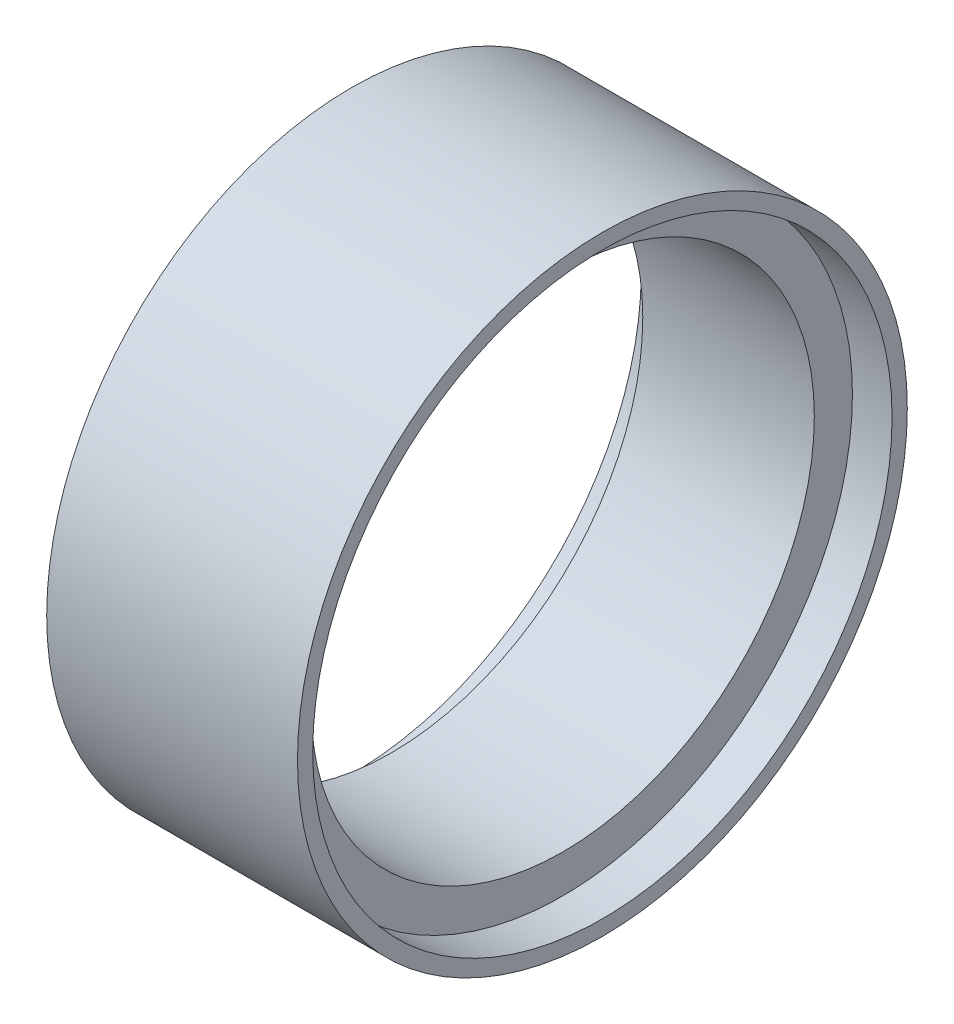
from build123d import *


with BuildPart() as part:
    # Esquisse1 → R_volution1 (revolve)
    with BuildSketch(Plane.XY, mode=Mode.PRIVATE) as r_volution1_sk:
        Polygon((0, 38), (0, 40), (32.9, 40), (32.9, 38), (27.7, 38), (27.7, 33), (5.2, 33), (5.2, 38), align=None)
    revolve(r_volution1_sk.sketch.rotate(Axis((0, 0, 0), (1, 0, 0)), 90), axis=Axis((0, 0, 0), (1, 0, 0)))


solid = part.part
